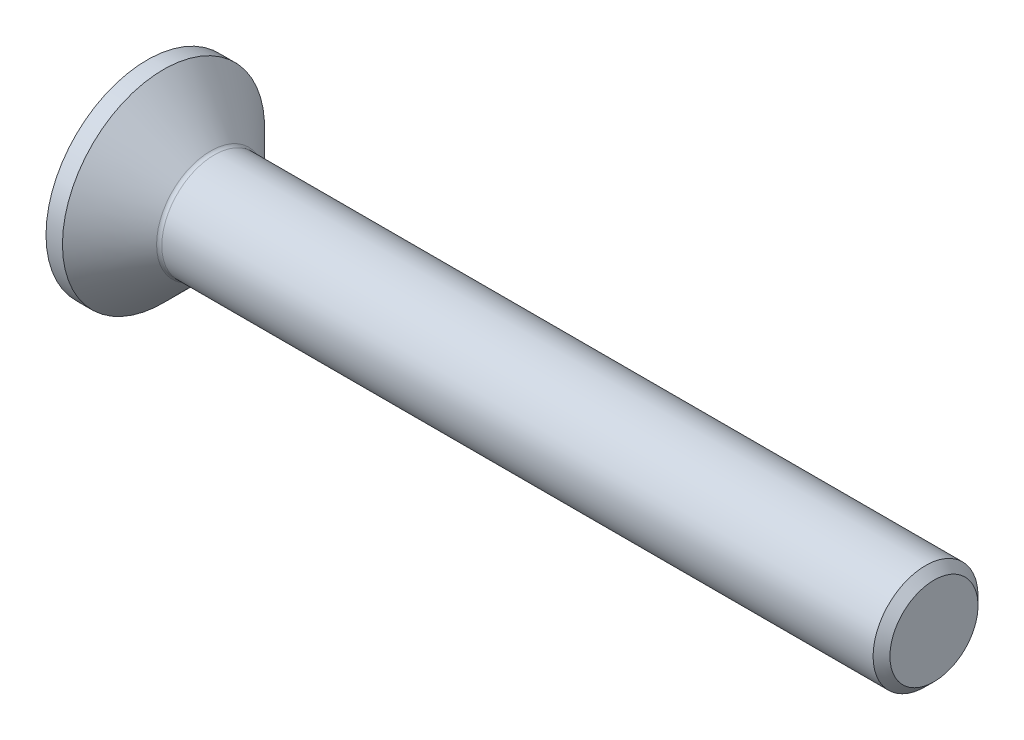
ISO-10303-21;
HEADER;
FILE_DESCRIPTION(('STEP AP214'),'2;1');
FILE_NAME('part.step','',(''),(''),'','','');
FILE_SCHEMA(('AUTOMOTIVE_DESIGN { 1 0 10303 214 1 1 1 1 }'));
ENDSEC;
DATA;
#1=APPLICATION_CONTEXT('core data for automotive mechanical design processes');
#2=APPLICATION_PROTOCOL_DEFINITION('international standard','automotive_design',2000,#1);
#3=PRODUCT_CONTEXT('',#1,'mechanical');
#4=PRODUCT('Part','Part','',(#3));
#5=PRODUCT_RELATED_PRODUCT_CATEGORY('part','',(#4));
#6=PRODUCT_DEFINITION_FORMATION('','',#4);
#7=PRODUCT_DEFINITION_CONTEXT('part definition',#1,'design');
#8=PRODUCT_DEFINITION('design','',#6,#7);
#9=PRODUCT_DEFINITION_SHAPE('','',#8);
#10=(LENGTH_UNIT() NAMED_UNIT(*) SI_UNIT(.MILLI.,.METRE.));
#11=(NAMED_UNIT(*) PLANE_ANGLE_UNIT() SI_UNIT($,.RADIAN.));
#12=(NAMED_UNIT(*) SI_UNIT($,.STERADIAN.) SOLID_ANGLE_UNIT());
#13=UNCERTAINTY_MEASURE_WITH_UNIT(LENGTH_MEASURE(1.E-05),#10,'distance_accuracy_value','');
#14=(GEOMETRIC_REPRESENTATION_CONTEXT(3) GLOBAL_UNCERTAINTY_ASSIGNED_CONTEXT((#13)) GLOBAL_UNIT_ASSIGNED_CONTEXT((#10,
#11,#12)) REPRESENTATION_CONTEXT('',''));
#15=CARTESIAN_POINT('',(0.,0.,0.));
#16=DIRECTION('',(0.,0.,1.));
#17=DIRECTION('',(1.,0.,0.));
#18=AXIS2_PLACEMENT_3D('',#15,#16,#17);
#19=CARTESIAN_POINT('',(0.,0.,0.));
#20=DIRECTION('',(-1.,0.,0.));
#21=DIRECTION('',(0.,0.,1.));
#22=AXIS2_PLACEMENT_3D('',#19,#20,#21);
#23=PLANE('',#22);
#24=CARTESIAN_POINT('',(0.,0.,0.));
#25=DIRECTION('',(-1.,0.,0.));
#26=DIRECTION('',(0.,0.,1.));
#27=AXIS2_PLACEMENT_3D('',#24,#25,#26);
#28=CIRCLE('',#27,11.56);
#29=CARTESIAN_POINT('',(0.,0.,11.56));
#30=VERTEX_POINT('',#29);
#31=EDGE_CURVE('E157',#30,#30,#28,.T.);
#32=ORIENTED_EDGE('',*,*,#31,.T.);
#33=EDGE_LOOP('',(#32));
#34=FACE_BOUND('',#33,.T.);
#35=DIRECTION('',(0.,-0.5,-0.866025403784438));
#36=VECTOR('',#35,1.);
#37=CARTESIAN_POINT('',(0.,-2.3094010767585,4.));
#38=LINE('',#37,#36);
#39=CARTESIAN_POINT('',(0.,-2.3094010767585,4.));
#40=VERTEX_POINT('',#39);
#41=CARTESIAN_POINT('',(0.,-4.61880215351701,0.));
#42=VERTEX_POINT('',#41);
#43=EDGE_CURVE('E119',#40,#42,#38,.T.);
#44=ORIENTED_EDGE('',*,*,#43,.T.);
#45=DIRECTION('',(0.,0.5,-0.866025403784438));
#46=VECTOR('',#45,1.);
#47=CARTESIAN_POINT('',(0.,-4.61880215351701,0.));
#48=LINE('',#47,#46);
#49=CARTESIAN_POINT('',(0.,-2.3094010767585,-4.));
#50=VERTEX_POINT('',#49);
#51=EDGE_CURVE('E49',#42,#50,#48,.T.);
#52=ORIENTED_EDGE('',*,*,#51,.T.);
#53=DIRECTION('',(0.,1.,0.));
#54=VECTOR('',#53,1.);
#55=CARTESIAN_POINT('',(0.,-2.3094010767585,-4.));
#56=LINE('',#55,#54);
#57=CARTESIAN_POINT('',(0.,2.3094010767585,-4.));
#58=VERTEX_POINT('',#57);
#59=EDGE_CURVE('E134',#50,#58,#56,.T.);
#60=ORIENTED_EDGE('',*,*,#59,.T.);
#61=DIRECTION('',(0.,0.5,0.866025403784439));
#62=VECTOR('',#61,1.);
#63=CARTESIAN_POINT('',(0.,2.3094010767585,-4.));
#64=LINE('',#63,#62);
#65=CARTESIAN_POINT('',(0.,4.61880215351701,0.));
#66=VERTEX_POINT('',#65);
#67=EDGE_CURVE('E270',#58,#66,#64,.T.);
#68=ORIENTED_EDGE('',*,*,#67,.T.);
#69=DIRECTION('',(0.,-0.5,0.866025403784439));
#70=VECTOR('',#69,1.);
#71=CARTESIAN_POINT('',(0.,4.61880215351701,0.));
#72=LINE('',#71,#70);
#73=CARTESIAN_POINT('',(0.,2.3094010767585,4.));
#74=VERTEX_POINT('',#73);
#75=EDGE_CURVE('E273',#66,#74,#72,.T.);
#76=ORIENTED_EDGE('',*,*,#75,.T.);
#77=DIRECTION('',(0.,-1.,0.));
#78=VECTOR('',#77,1.);
#79=CARTESIAN_POINT('',(0.,2.3094010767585,4.));
#80=LINE('',#79,#78);
#81=EDGE_CURVE('E276',#74,#40,#80,.T.);
#82=ORIENTED_EDGE('',*,*,#81,.T.);
#83=EDGE_LOOP('',(#44,#52,#60,#68,#76,#82));
#84=FACE_BOUND('',#83,.T.);
#85=ADVANCED_FACE('F34',(#34,#84),#23,.T.);
#86=CARTESIAN_POINT('',(0.,0.,0.));
#87=DIRECTION('',(-1.,0.,0.));
#88=DIRECTION('',(0.,0.,1.));
#89=AXIS2_PLACEMENT_3D('',#86,#87,#88);
#90=CYLINDRICAL_SURFACE('',#89,11.56);
#91=CARTESIAN_POINT('',(1.88000000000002,0.,0.));
#92=DIRECTION('',(-1.,0.,0.));
#93=DIRECTION('',(0.,0.,1.));
#94=AXIS2_PLACEMENT_3D('',#91,#92,#93);
#95=CIRCLE('',#94,11.56);
#96=CARTESIAN_POINT('',(1.88000000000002,0.,11.56));
#97=VERTEX_POINT('',#96);
#98=EDGE_CURVE('E154',#97,#97,#95,.T.);
#99=ORIENTED_EDGE('',*,*,#98,.T.);
#100=EDGE_LOOP('',(#99));
#101=FACE_BOUND('',#100,.T.);
#102=ORIENTED_EDGE('',*,*,#31,.F.);
#103=EDGE_LOOP('',(#102));
#104=FACE_BOUND('',#103,.T.);
#105=ADVANCED_FACE('F178',(#101,#104),#90,.T.);
#106=CARTESIAN_POINT('',(1.88000000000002,0.,0.));
#107=DIRECTION('',(-1.,0.,0.));
#108=DIRECTION('',(0.,0.,1.));
#109=AXIS2_PLACEMENT_3D('',#106,#107,#108);
#110=CONICAL_SURFACE('',#109,11.56,0.78539816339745);
#111=CARTESIAN_POINT('',(7.26426406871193,0.,0.));
#112=DIRECTION('',(-1.,0.,0.));
#113=DIRECTION('',(0.,0.,1.));
#114=AXIS2_PLACEMENT_3D('',#111,#112,#113);
#115=CIRCLE('',#114,6.17573593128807);
#116=CARTESIAN_POINT('',(7.26426406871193,0.,6.17573593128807));
#117=VERTEX_POINT('',#116);
#118=EDGE_CURVE('E42',#117,#117,#115,.T.);
#119=ORIENTED_EDGE('',*,*,#118,.T.);
#120=EDGE_LOOP('',(#119));
#121=FACE_BOUND('',#120,.T.);
#122=ORIENTED_EDGE('',*,*,#98,.F.);
#123=EDGE_LOOP('',(#122));
#124=FACE_BOUND('',#123,.T.);
#125=ADVANCED_FACE('F162',(#121,#124),#110,.T.);
#126=CARTESIAN_POINT('',(0.,0.,0.));
#127=DIRECTION('',(-1.,0.,0.));
#128=DIRECTION('',(0.,0.,1.));
#129=AXIS2_PLACEMENT_3D('',#126,#127,#128);
#130=CYLINDRICAL_SURFACE('',#129,6.);
#131=CARTESIAN_POINT('',(7.68852813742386,0.,0.));
#132=DIRECTION('',(-1.,0.,0.));
#133=DIRECTION('',(0.,0.,1.));
#134=AXIS2_PLACEMENT_3D('',#131,#132,#133);
#135=CIRCLE('',#134,6.);
#136=CARTESIAN_POINT('',(7.68852813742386,0.,6.));
#137=VERTEX_POINT('',#136);
#138=EDGE_CURVE('E11',#137,#137,#135,.F.);
#139=ORIENTED_EDGE('',*,*,#138,.T.);
#140=EDGE_LOOP('',(#139));
#141=FACE_BOUND('',#140,.T.);
#142=CARTESIAN_POINT('',(89.036,0.,0.));
#143=DIRECTION('',(-1.,0.,0.));
#144=DIRECTION('',(0.,0.,1.));
#145=AXIS2_PLACEMENT_3D('',#142,#143,#144);
#146=CIRCLE('',#145,6.);
#147=CARTESIAN_POINT('',(89.036,0.,6.));
#148=VERTEX_POINT('',#147);
#149=EDGE_CURVE('E151',#148,#148,#146,.T.);
#150=ORIENTED_EDGE('',*,*,#149,.T.);
#151=EDGE_LOOP('',(#150));
#152=FACE_BOUND('',#151,.T.);
#153=ADVANCED_FACE('F189',(#141,#152),#130,.T.);
#154=CARTESIAN_POINT('',(90.,0.,0.));
#155=DIRECTION('',(-1.,0.,0.));
#156=DIRECTION('',(0.,0.,1.));
#157=AXIS2_PLACEMENT_3D('',#154,#155,#156);
#158=CONICAL_SURFACE('',#157,5.036,0.785398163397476);
#159=ORIENTED_EDGE('',*,*,#149,.F.);
#160=EDGE_LOOP('',(#159));
#161=FACE_BOUND('',#160,.T.);
#162=CARTESIAN_POINT('',(90.,0.,0.));
#163=DIRECTION('',(-1.,0.,0.));
#164=DIRECTION('',(0.,0.,1.));
#165=AXIS2_PLACEMENT_3D('',#162,#163,#164);
#166=CIRCLE('',#165,5.036);
#167=CARTESIAN_POINT('',(90.,0.,5.036));
#168=VERTEX_POINT('',#167);
#169=EDGE_CURVE('E147',#168,#168,#166,.T.);
#170=ORIENTED_EDGE('',*,*,#169,.T.);
#171=EDGE_LOOP('',(#170));
#172=FACE_BOUND('',#171,.T.);
#173=ADVANCED_FACE('F173',(#161,#172),#158,.T.);
#174=CARTESIAN_POINT('',(90.,5.036,0.));
#175=DIRECTION('',(1.,0.,0.));
#176=DIRECTION('',(0.,0.,-1.));
#177=AXIS2_PLACEMENT_3D('',#174,#175,#176);
#178=PLANE('',#177);
#179=ORIENTED_EDGE('',*,*,#169,.F.);
#180=EDGE_LOOP('',(#179));
#181=FACE_BOUND('',#180,.T.);
#182=ADVANCED_FACE('F166',(#181),#178,.T.);
#183=CARTESIAN_POINT('',(7.68852813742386,0.,0.));
#184=DIRECTION('',(-1.,0.,0.));
#185=DIRECTION('',(0.,0.,1.));
#186=AXIS2_PLACEMENT_3D('',#183,#184,#185);
#187=TOROIDAL_SURFACE('',#186,6.6,0.6);
#188=ORIENTED_EDGE('',*,*,#138,.F.);
#189=EDGE_LOOP('',(#188));
#190=FACE_BOUND('',#189,.T.);
#191=ORIENTED_EDGE('',*,*,#118,.F.);
#192=EDGE_LOOP('',(#191));
#193=FACE_BOUND('',#192,.T.);
#194=ADVANCED_FACE('F36',(#190,#193),#187,.F.);
#195=CARTESIAN_POINT('',(4.3,-4.61880215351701,0.));
#196=DIRECTION('',(0.,0.866025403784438,0.5));
#197=DIRECTION('',(0.,-0.5,0.866025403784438));
#198=AXIS2_PLACEMENT_3D('',#195,#196,#197);
#199=PLANE('',#198);
#200=ORIENTED_EDGE('',*,*,#51,.F.);
#201=DIRECTION('',(-1.,0.,0.));
#202=VECTOR('',#201,1.);
#203=CARTESIAN_POINT('',(4.3,-4.61880215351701,0.));
#204=LINE('',#203,#202);
#205=CARTESIAN_POINT('',(4.3,-4.61880215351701,0.));
#206=VERTEX_POINT('',#205);
#207=EDGE_CURVE('E267',#206,#42,#204,.T.);
#208=ORIENTED_EDGE('',*,*,#207,.F.);
#209=DIRECTION('',(0.,0.5,-0.866025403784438));
#210=VECTOR('',#209,1.);
#211=CARTESIAN_POINT('',(4.3,-4.61880215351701,0.));
#212=LINE('',#211,#210);
#213=CARTESIAN_POINT('',(4.3,-3.46410161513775,-2.));
#214=VERTEX_POINT('',#213);
#215=EDGE_CURVE('E116',#206,#214,#212,.T.);
#216=ORIENTED_EDGE('',*,*,#215,.T.);
#217=CARTESIAN_POINT('',(4.3,-2.3094010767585,-4.));
#218=VERTEX_POINT('',#217);
#219=EDGE_CURVE('E110',#214,#218,#212,.T.);
#220=ORIENTED_EDGE('',*,*,#219,.T.);
#221=DIRECTION('',(-1.,0.,0.));
#222=VECTOR('',#221,1.);
#223=CARTESIAN_POINT('',(4.3,-2.3094010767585,-4.));
#224=LINE('',#223,#222);
#225=EDGE_CURVE('E114',#218,#50,#224,.T.);
#226=ORIENTED_EDGE('',*,*,#225,.T.);
#227=EDGE_LOOP('',(#200,#208,#216,#220,#226));
#228=FACE_BOUND('',#227,.T.);
#229=ADVANCED_FACE('F112',(#228),#199,.T.);
#230=CARTESIAN_POINT('',(4.3,-2.3094010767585,-4.));
#231=DIRECTION('',(0.,0.,1.));
#232=DIRECTION('',(1.,0.,0.));
#233=AXIS2_PLACEMENT_3D('',#230,#231,#232);
#234=PLANE('',#233);
#235=ORIENTED_EDGE('',*,*,#59,.F.);
#236=ORIENTED_EDGE('',*,*,#225,.F.);
#237=DIRECTION('',(0.,1.,0.));
#238=VECTOR('',#237,1.);
#239=CARTESIAN_POINT('',(4.3,-2.3094010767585,-4.));
#240=LINE('',#239,#238);
#241=CARTESIAN_POINT('',(4.3,0.,-4.));
#242=VERTEX_POINT('',#241);
#243=EDGE_CURVE('E122',#218,#242,#240,.T.);
#244=ORIENTED_EDGE('',*,*,#243,.T.);
#245=CARTESIAN_POINT('',(4.3,2.3094010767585,-4.));
#246=VERTEX_POINT('',#245);
#247=EDGE_CURVE('E129',#242,#246,#240,.T.);
#248=ORIENTED_EDGE('',*,*,#247,.T.);
#249=DIRECTION('',(-1.,0.,0.));
#250=VECTOR('',#249,1.);
#251=CARTESIAN_POINT('',(4.3,2.3094010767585,-4.));
#252=LINE('',#251,#250);
#253=EDGE_CURVE('E136',#246,#58,#252,.T.);
#254=ORIENTED_EDGE('',*,*,#253,.T.);
#255=EDGE_LOOP('',(#235,#236,#244,#248,#254));
#256=FACE_BOUND('',#255,.T.);
#257=ADVANCED_FACE('F131',(#256),#234,.T.);
#258=CARTESIAN_POINT('',(4.3,2.3094010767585,-4.));
#259=DIRECTION('',(0.,-0.866025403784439,0.5));
#260=DIRECTION('',(0.,-0.5,-0.866025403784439));
#261=AXIS2_PLACEMENT_3D('',#258,#259,#260);
#262=PLANE('',#261);
#263=ORIENTED_EDGE('',*,*,#67,.F.);
#264=ORIENTED_EDGE('',*,*,#253,.F.);
#265=DIRECTION('',(0.,0.5,0.866025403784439));
#266=VECTOR('',#265,1.);
#267=CARTESIAN_POINT('',(4.3,2.3094010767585,-4.));
#268=LINE('',#267,#266);
#269=CARTESIAN_POINT('',(4.3,3.46410161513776,-2.));
#270=VERTEX_POINT('',#269);
#271=EDGE_CURVE('E259',#246,#270,#268,.T.);
#272=ORIENTED_EDGE('',*,*,#271,.T.);
#273=CARTESIAN_POINT('',(4.3,4.61880215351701,0.));
#274=VERTEX_POINT('',#273);
#275=EDGE_CURVE('E128',#270,#274,#268,.T.);
#276=ORIENTED_EDGE('',*,*,#275,.T.);
#277=DIRECTION('',(-1.,0.,0.));
#278=VECTOR('',#277,1.);
#279=CARTESIAN_POINT('',(4.3,4.61880215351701,0.));
#280=LINE('',#279,#278);
#281=EDGE_CURVE('E142',#274,#66,#280,.T.);
#282=ORIENTED_EDGE('',*,*,#281,.T.);
#283=EDGE_LOOP('',(#263,#264,#272,#276,#282));
#284=FACE_BOUND('',#283,.T.);
#285=ADVANCED_FACE('F203',(#284),#262,.T.);
#286=CARTESIAN_POINT('',(4.3,4.61880215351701,0.));
#287=DIRECTION('',(0.,-0.866025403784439,-0.5));
#288=DIRECTION('',(0.,0.5,-0.866025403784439));
#289=AXIS2_PLACEMENT_3D('',#286,#287,#288);
#290=PLANE('',#289);
#291=ORIENTED_EDGE('',*,*,#75,.F.);
#292=ORIENTED_EDGE('',*,*,#281,.F.);
#293=DIRECTION('',(0.,-0.5,0.866025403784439));
#294=VECTOR('',#293,1.);
#295=CARTESIAN_POINT('',(4.3,4.61880215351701,0.));
#296=LINE('',#295,#294);
#297=CARTESIAN_POINT('',(4.3,3.46410161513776,2.));
#298=VERTEX_POINT('',#297);
#299=EDGE_CURVE('E57',#274,#298,#296,.T.);
#300=ORIENTED_EDGE('',*,*,#299,.T.);
#301=CARTESIAN_POINT('',(4.3,2.3094010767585,4.));
#302=VERTEX_POINT('',#301);
#303=EDGE_CURVE('E238',#298,#302,#296,.T.);
#304=ORIENTED_EDGE('',*,*,#303,.T.);
#305=DIRECTION('',(-1.,0.,0.));
#306=VECTOR('',#305,1.);
#307=CARTESIAN_POINT('',(4.3,2.3094010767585,4.));
#308=LINE('',#307,#306);
#309=EDGE_CURVE('E252',#302,#74,#308,.T.);
#310=ORIENTED_EDGE('',*,*,#309,.T.);
#311=EDGE_LOOP('',(#291,#292,#300,#304,#310));
#312=FACE_BOUND('',#311,.T.);
#313=ADVANCED_FACE('F206',(#312),#290,.T.);
#314=CARTESIAN_POINT('',(4.3,2.3094010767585,4.));
#315=DIRECTION('',(0.,0.,-1.));
#316=DIRECTION('',(-1.,0.,0.));
#317=AXIS2_PLACEMENT_3D('',#314,#315,#316);
#318=PLANE('',#317);
#319=ORIENTED_EDGE('',*,*,#81,.F.);
#320=ORIENTED_EDGE('',*,*,#309,.F.);
#321=DIRECTION('',(0.,-1.,0.));
#322=VECTOR('',#321,1.);
#323=CARTESIAN_POINT('',(4.3,2.3094010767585,4.));
#324=LINE('',#323,#322);
#325=CARTESIAN_POINT('',(4.3,0.,4.));
#326=VERTEX_POINT('',#325);
#327=EDGE_CURVE('E237',#302,#326,#324,.T.);
#328=ORIENTED_EDGE('',*,*,#327,.T.);
#329=CARTESIAN_POINT('',(4.3,-2.3094010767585,4.));
#330=VERTEX_POINT('',#329);
#331=EDGE_CURVE('E243',#326,#330,#324,.T.);
#332=ORIENTED_EDGE('',*,*,#331,.T.);
#333=DIRECTION('',(-1.,0.,0.));
#334=VECTOR('',#333,1.);
#335=CARTESIAN_POINT('',(4.3,-2.3094010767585,4.));
#336=LINE('',#335,#334);
#337=EDGE_CURVE('E282',#330,#40,#336,.T.);
#338=ORIENTED_EDGE('',*,*,#337,.T.);
#339=EDGE_LOOP('',(#319,#320,#328,#332,#338));
#340=FACE_BOUND('',#339,.T.);
#341=ADVANCED_FACE('F210',(#340),#318,.T.);
#342=CARTESIAN_POINT('',(4.3,-2.3094010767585,4.));
#343=DIRECTION('',(0.,0.866025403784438,-0.5));
#344=DIRECTION('',(0.,0.5,0.866025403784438));
#345=AXIS2_PLACEMENT_3D('',#342,#343,#344);
#346=PLANE('',#345);
#347=ORIENTED_EDGE('',*,*,#43,.F.);
#348=ORIENTED_EDGE('',*,*,#337,.F.);
#349=DIRECTION('',(0.,-0.5,-0.866025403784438));
#350=VECTOR('',#349,1.);
#351=CARTESIAN_POINT('',(4.3,-2.3094010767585,4.));
#352=LINE('',#351,#350);
#353=CARTESIAN_POINT('',(4.3,-3.46410161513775,2.));
#354=VERTEX_POINT('',#353);
#355=EDGE_CURVE('E246',#330,#354,#352,.T.);
#356=ORIENTED_EDGE('',*,*,#355,.T.);
#357=EDGE_CURVE('E253',#354,#206,#352,.T.);
#358=ORIENTED_EDGE('',*,*,#357,.T.);
#359=ORIENTED_EDGE('',*,*,#207,.T.);
#360=EDGE_LOOP('',(#347,#348,#356,#358,#359));
#361=FACE_BOUND('',#360,.T.);
#362=ADVANCED_FACE('F213',(#361),#346,.T.);
#363=CARTESIAN_POINT('',(4.3,-4.61880215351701,0.));
#364=DIRECTION('',(-1.,0.,0.));
#365=DIRECTION('',(0.,0.,1.));
#366=AXIS2_PLACEMENT_3D('',#363,#364,#365);
#367=PLANE('',#366);
#368=CARTESIAN_POINT('',(4.3,0.,0.));
#369=DIRECTION('',(-1.,0.,0.));
#370=DIRECTION('',(0.,0.,1.));
#371=AXIS2_PLACEMENT_3D('',#368,#369,#370);
#372=CIRCLE('',#371,4.);
#373=EDGE_CURVE('E135',#354,#326,#372,.T.);
#374=ORIENTED_EDGE('',*,*,#373,.F.);
#375=ORIENTED_EDGE('',*,*,#355,.F.);
#376=ORIENTED_EDGE('',*,*,#331,.F.);
#377=EDGE_LOOP('',(#374,#375,#376));
#378=FACE_BOUND('',#377,.T.);
#379=ADVANCED_FACE('F217',(#378),#367,.T.);
#380=EDGE_CURVE('E139',#214,#354,#372,.T.);
#381=ORIENTED_EDGE('',*,*,#380,.F.);
#382=ORIENTED_EDGE('',*,*,#215,.F.);
#383=ORIENTED_EDGE('',*,*,#357,.F.);
#384=EDGE_LOOP('',(#381,#382,#383));
#385=FACE_BOUND('',#384,.T.);
#386=ADVANCED_FACE('F220',(#385),#367,.T.);
#387=EDGE_CURVE('E124',#242,#214,#372,.T.);
#388=ORIENTED_EDGE('',*,*,#387,.F.);
#389=ORIENTED_EDGE('',*,*,#243,.F.);
#390=ORIENTED_EDGE('',*,*,#219,.F.);
#391=EDGE_LOOP('',(#388,#389,#390));
#392=FACE_BOUND('',#391,.T.);
#393=ADVANCED_FACE('F123',(#392),#367,.T.);
#394=EDGE_CURVE('E255',#270,#242,#372,.T.);
#395=ORIENTED_EDGE('',*,*,#394,.F.);
#396=ORIENTED_EDGE('',*,*,#271,.F.);
#397=ORIENTED_EDGE('',*,*,#247,.F.);
#398=EDGE_LOOP('',(#395,#396,#397));
#399=FACE_BOUND('',#398,.T.);
#400=ADVANCED_FACE('F232',(#399),#367,.T.);
#401=EDGE_CURVE('E148',#298,#270,#372,.T.);
#402=ORIENTED_EDGE('',*,*,#401,.F.);
#403=ORIENTED_EDGE('',*,*,#299,.F.);
#404=ORIENTED_EDGE('',*,*,#275,.F.);
#405=EDGE_LOOP('',(#402,#403,#404));
#406=FACE_BOUND('',#405,.T.);
#407=ADVANCED_FACE('F227',(#406),#367,.T.);
#408=EDGE_CURVE('E141',#326,#298,#372,.T.);
#409=ORIENTED_EDGE('',*,*,#408,.F.);
#410=ORIENTED_EDGE('',*,*,#327,.F.);
#411=ORIENTED_EDGE('',*,*,#303,.F.);
#412=EDGE_LOOP('',(#409,#410,#411));
#413=FACE_BOUND('',#412,.T.);
#414=ADVANCED_FACE('F198',(#413),#367,.T.);
#415=CARTESIAN_POINT('',(4.3,0.,0.));
#416=DIRECTION('',(-1.,0.,0.));
#417=DIRECTION('',(0.,0.,1.));
#418=AXIS2_PLACEMENT_3D('',#415,#416,#417);
#419=CONICAL_SURFACE('',#418,4.,1.04719755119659);
#420=CARTESIAN_POINT('',(6.60940107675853,0.,0.));
#421=VERTEX_POINT('',#420);
#422=VERTEX_LOOP('',#421);
#423=FACE_BOUND('',#422,.T.);
#424=ORIENTED_EDGE('',*,*,#408,.T.);
#425=ORIENTED_EDGE('',*,*,#401,.T.);
#426=ORIENTED_EDGE('',*,*,#394,.T.);
#427=ORIENTED_EDGE('',*,*,#387,.T.);
#428=ORIENTED_EDGE('',*,*,#380,.T.);
#429=ORIENTED_EDGE('',*,*,#373,.T.);
#430=EDGE_LOOP('',(#424,#425,#426,#427,#428,#429));
#431=FACE_BOUND('',#430,.T.);
#432=ADVANCED_FACE('F196',(#423,#431),#419,.F.);
#433=CLOSED_SHELL('',(#85,#105,#125,#153,#173,#182,#194,#229,#257,#285,#313,#341,#362,#379,#386,
#393,#400,#407,#414,#432));
#434=MANIFOLD_SOLID_BREP('B2',#433);
#435=ADVANCED_BREP_SHAPE_REPRESENTATION('',(#18,#434),#14);
#436=SHAPE_DEFINITION_REPRESENTATION(#9,#435);
ENDSEC;
END-ISO-10303-21;
